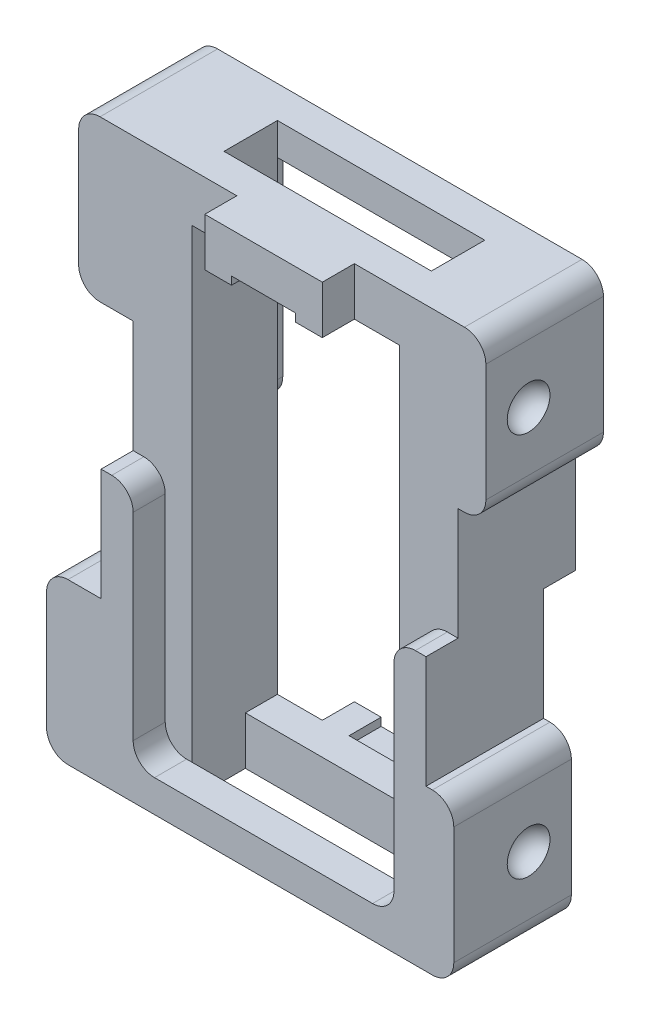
from build123d import *

# Parameters (mm, degrees)
BODY_W                   = 30.4
BODY_H                   = 51
BODY_W_2                 = 19.4
BODY_H_2                 = 42
MAIN_BODY_DEPTH          = 4
CLAMP_WALLS_1_DEPTH      = 3
CLAMP_WALLS_1_DEPTH_BACK = 8
CLAMP_WALLS_2_DEPTH      = 3
SKETCH7_W                = 11
SKETCH7_H                = 15
STANDOFF_1_DEPTH         = 5.1
SKETCH8_W                = 11
SKETCH8_H                = 15
STANDOFF_2_DEPTH         = 2.6
CONTOURING_R             = 2
SKETCH11_W               = 19.4
SKETCH11_H               = 5
VENTILATION_1_DEPTH      = 4.5
SKETCH12_W               = 19.4
SKETCH12_H               = 5
VENTILATION_2_DEPTH      = 4.5


with BuildPart() as part:
    # Body → Main Body (new, symmetric)
    with BuildSketch(Plane.XY):
        Rectangle(BODY_W, BODY_H)
        Rectangle(BODY_W_2, BODY_H_2, mode=Mode.SUBTRACT)
    extrude(amount=MAIN_BODY_DEPTH, both=True)

    # Sketch2 → Clamp Walls 1 (add, two sides: drawn at the far end of the back side and taken through both)
    with BuildSketch(Plane.XY.offset(4).offset(-CLAMP_WALLS_1_DEPTH_BACK)):
        Polygon((-12.2, 0), (-15.2, 0), (-15.2, -25.5), (15.2, -25.5), (15.2, 0), (12.2, 0), (12.2, -22.5), (-12.2, -22.5), align=None)
        Polygon((-5.5, 25.5), (5.5, 25.5), (5.5, 21), (3, 21), (3, 21.75), (-3, 21.75), (-3, 21), (-5.5, 21), align=None)
    extrude(amount=CLAMP_WALLS_1_DEPTH + CLAMP_WALLS_1_DEPTH_BACK)

    # Sketch3 → Clamp Walls 2 (add)
    with BuildSketch(Plane(origin=(0, 0, -4), x_dir=(-1, 0, 0), z_dir=(0, 0, -1))):
        Polygon((15.2, 0), (15.2, 25.5), (-15.2, 25.5), (-15.2, 0), (-12.2, 0), (-12.2, 22.5), (12.2, 22.5), (12.2, 0), align=None)
        Polygon((5.5, -25.5), (5.5, -21), (3, -21), (3, -21.75), (-3, -21.75), (-3, -21), (-5.5, -21), (-5.5, -25.5), align=None)
    extrude(amount=CLAMP_WALLS_2_DEPTH)

    # Sketch7 → Standoff 1 (add)
    with BuildSketch(Plane.ZY.offset(15.2)):
        with Locations((1.5, -18)):
            Rectangle(SKETCH7_W, SKETCH7_H)
        with Locations((-1.5, 18)):
            Rectangle(SKETCH7_W, SKETCH7_H)
    extrude(amount=STANDOFF_1_DEPTH)

    # Sketch8 → Standoff 2 (add)
    with BuildSketch(Plane(origin=(15.2, 0, 0), x_dir=(0, 0, -1), z_dir=(1, 0, 0))):
        with Locations((-1.5, -18)):
            Rectangle(SKETCH8_W, SKETCH8_H)
        with Locations((1.5, 18)):
            Rectangle(SKETCH8_W, SKETCH8_H)
    extrude(amount=STANDOFF_2_DEPTH)

    # Sketch9 → Mounting 1 (revolve, cut)
    with BuildSketch(Plane(origin=(17.8, 0, 0), x_dir=(0, 0, -1), z_dir=(1, 0, 0))):
        with BuildLine():
            Line((0, -20), (0, -16))
            ThreePointArc((0, -16), (2, -18), (0, -20))
        make_face()
        with BuildLine():
            Line((0, 20), (0, 16))
            ThreePointArc((0, 16), (2, 18), (0, 20))
        make_face()
    revolve(axis=Axis((17.8, -10.5, 0), (0, -1, 0)), mode=Mode.SUBTRACT)

    # Contouring
    contouring_edges = [part.edges().sort_by_distance(p)[0] for p in [
        (-20.3, -10.5, 1.5),
        (-20.3, 10.5, -1.5),
        (17.8, 10.5, -1.5),
        (17.8, -10.5, 1.5),
        (-12.2, 0, 5.5),
        (12.2, 0, 5.5),
        (12.2, 0, -5.5),
        (-12.2, 0, -5.5),
        (12.2, 22.5, -5.5),
        (-12.2, 22.5, -5.5),
        (-12.2, -22.5, 5.5),
        (12.2, -22.5, 5.5),
        (-20.3, -25.5, 1.5),
        (-20.3, 25.5, -1.5),
        (17.8, 25.5, -1.5),
        (17.8, -25.5, 1.5),
    ]]
    fillet(contouring_edges, radius=CONTOURING_R)

    # Sketch11 → Ventilation 1 (cut)
    with BuildSketch(Plane(origin=(0, 25.5, 0), x_dir=(1, 0, 0), z_dir=(0, 1, 0))):
        with Locations((0, 1.5)):
            Rectangle(SKETCH11_W, SKETCH11_H)
    extrude(amount=-VENTILATION_1_DEPTH, mode=Mode.SUBTRACT)

    # Sketch12 → Ventilation 2 (cut)
    with BuildSketch(Plane.XZ.offset(25.5)):
        with Locations((0, 1.5)):
            Rectangle(SKETCH12_W, SKETCH12_H)
    extrude(amount=-VENTILATION_2_DEPTH, mode=Mode.SUBTRACT)


solid = part.part
